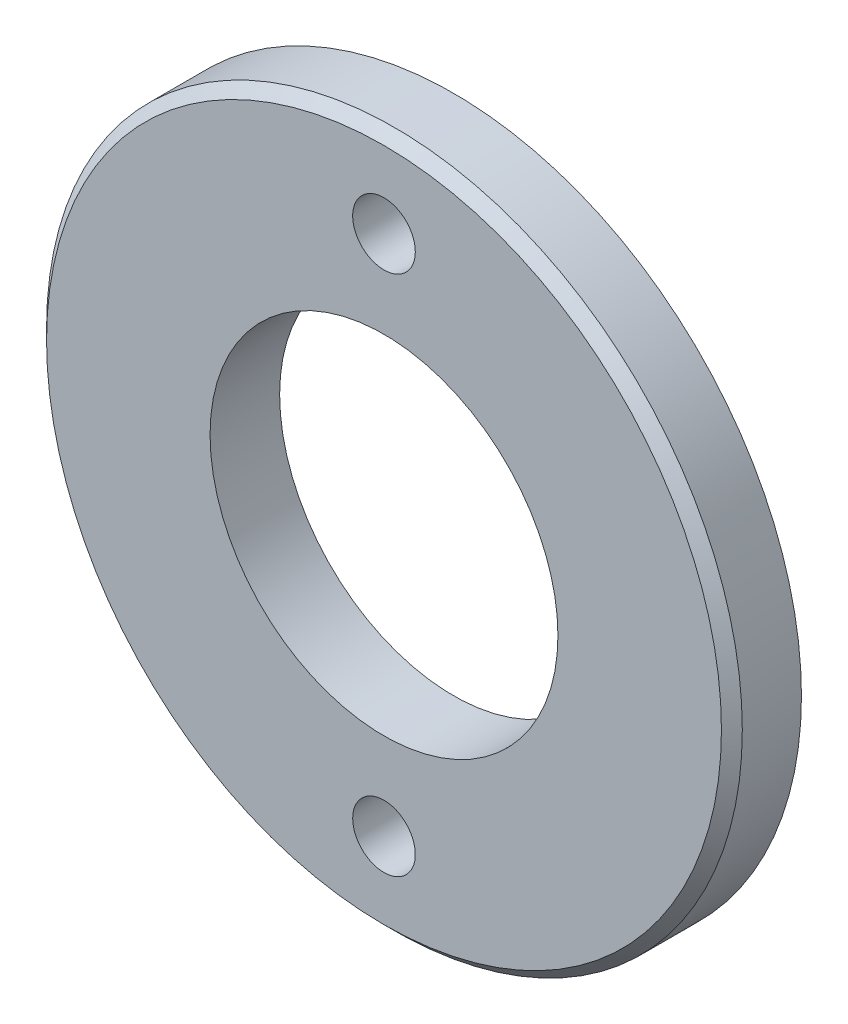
ISO-10303-21;
HEADER;
FILE_DESCRIPTION(('STEP AP214'),'2;1');
FILE_NAME('part.step','',(''),(''),'','','');
FILE_SCHEMA(('AUTOMOTIVE_DESIGN { 1 0 10303 214 1 1 1 1 }'));
ENDSEC;
DATA;
#1=APPLICATION_CONTEXT('core data for automotive mechanical design processes');
#2=APPLICATION_PROTOCOL_DEFINITION('international standard','automotive_design',2000,#1);
#3=PRODUCT_CONTEXT('',#1,'mechanical');
#4=PRODUCT('Part','Part','',(#3));
#5=PRODUCT_RELATED_PRODUCT_CATEGORY('part','',(#4));
#6=PRODUCT_DEFINITION_FORMATION('','',#4);
#7=PRODUCT_DEFINITION_CONTEXT('part definition',#1,'design');
#8=PRODUCT_DEFINITION('design','',#6,#7);
#9=PRODUCT_DEFINITION_SHAPE('','',#8);
#10=(LENGTH_UNIT() NAMED_UNIT(*) SI_UNIT(.MILLI.,.METRE.));
#11=(NAMED_UNIT(*) PLANE_ANGLE_UNIT() SI_UNIT($,.RADIAN.));
#12=(NAMED_UNIT(*) SI_UNIT($,.STERADIAN.) SOLID_ANGLE_UNIT());
#13=UNCERTAINTY_MEASURE_WITH_UNIT(LENGTH_MEASURE(1.E-05),#10,'distance_accuracy_value','');
#14=(GEOMETRIC_REPRESENTATION_CONTEXT(3) GLOBAL_UNCERTAINTY_ASSIGNED_CONTEXT((#13)) GLOBAL_UNIT_ASSIGNED_CONTEXT((#10,
#11,#12)) REPRESENTATION_CONTEXT('',''));
#15=CARTESIAN_POINT('',(0.,0.,0.));
#16=DIRECTION('',(0.,0.,1.));
#17=DIRECTION('',(1.,0.,0.));
#18=AXIS2_PLACEMENT_3D('',#15,#16,#17);
#19=CARTESIAN_POINT('',(0.,0.,2.54));
#20=DIRECTION('',(0.,0.,-1.));
#21=DIRECTION('',(-1.,0.,0.));
#22=AXIS2_PLACEMENT_3D('',#19,#20,#21);
#23=CYLINDRICAL_SURFACE('',#22,25.4);
#24=CARTESIAN_POINT('',(0.,0.,1.778));
#25=DIRECTION('',(0.,0.,1.));
#26=DIRECTION('',(1.,0.,0.));
#27=AXIS2_PLACEMENT_3D('',#24,#25,#26);
#28=CIRCLE('',#27,25.4);
#29=CARTESIAN_POINT('',(25.4,0.,1.778));
#30=VERTEX_POINT('',#29);
#31=EDGE_CURVE('E10',#30,#30,#28,.F.);
#32=ORIENTED_EDGE('',*,*,#31,.T.);
#33=EDGE_LOOP('',(#32));
#34=FACE_BOUND('',#33,.T.);
#35=CARTESIAN_POINT('',(0.,0.,-2.54));
#36=DIRECTION('',(0.,0.,1.));
#37=DIRECTION('',(1.,0.,0.));
#38=AXIS2_PLACEMENT_3D('',#35,#36,#37);
#39=CIRCLE('',#38,25.4);
#40=CARTESIAN_POINT('',(25.4,0.,-2.54));
#41=VERTEX_POINT('',#40);
#42=EDGE_CURVE('E42',#41,#41,#39,.T.);
#43=ORIENTED_EDGE('',*,*,#42,.T.);
#44=EDGE_LOOP('',(#43));
#45=FACE_BOUND('',#44,.T.);
#46=ADVANCED_FACE('F31',(#34,#45),#23,.T.);
#47=CARTESIAN_POINT('',(0.,0.,2.54));
#48=DIRECTION('',(0.,0.,1.));
#49=DIRECTION('',(1.,0.,0.));
#50=AXIS2_PLACEMENT_3D('',#47,#48,#49);
#51=PLANE('',#50);
#52=CARTESIAN_POINT('',(0.,0.,2.54));
#53=DIRECTION('',(0.,0.,1.));
#54=DIRECTION('',(1.,0.,0.));
#55=AXIS2_PLACEMENT_3D('',#52,#53,#54);
#56=CIRCLE('',#55,24.638);
#57=CARTESIAN_POINT('',(24.638,0.,2.54));
#58=VERTEX_POINT('',#57);
#59=EDGE_CURVE('E38',#58,#58,#56,.T.);
#60=ORIENTED_EDGE('',*,*,#59,.T.);
#61=EDGE_LOOP('',(#60));
#62=FACE_BOUND('',#61,.T.);
#63=CARTESIAN_POINT('',(-1.33025439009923E-13,-19.05,2.54));
#64=DIRECTION('',(0.,0.,1.));
#65=DIRECTION('',(-1.,0.,0.));
#66=AXIS2_PLACEMENT_3D('',#63,#64,#65);
#67=CIRCLE('',#66,2.286);
#68=CARTESIAN_POINT('',(-2.28600000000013,-19.05,2.54));
#69=VERTEX_POINT('',#68);
#70=EDGE_CURVE('E61',#69,#69,#67,.T.);
#71=ORIENTED_EDGE('',*,*,#70,.F.);
#72=EDGE_LOOP('',(#71));
#73=FACE_BOUND('',#72,.T.);
#74=CARTESIAN_POINT('',(0.,19.05,2.54));
#75=DIRECTION('',(0.,0.,1.));
#76=DIRECTION('',(1.,0.,0.));
#77=AXIS2_PLACEMENT_3D('',#74,#75,#76);
#78=CIRCLE('',#77,2.286);
#79=CARTESIAN_POINT('',(2.286,19.05,2.54));
#80=VERTEX_POINT('',#79);
#81=EDGE_CURVE('E55',#80,#80,#78,.T.);
#82=ORIENTED_EDGE('',*,*,#81,.F.);
#83=EDGE_LOOP('',(#82));
#84=FACE_BOUND('',#83,.T.);
#85=CARTESIAN_POINT('',(0.,0.,2.54));
#86=DIRECTION('',(0.,0.,1.));
#87=DIRECTION('',(1.,0.,0.));
#88=AXIS2_PLACEMENT_3D('',#85,#86,#87);
#89=CIRCLE('',#88,12.7);
#90=CARTESIAN_POINT('',(12.7,0.,2.54));
#91=VERTEX_POINT('',#90);
#92=EDGE_CURVE('E49',#91,#91,#89,.T.);
#93=ORIENTED_EDGE('',*,*,#92,.F.);
#94=EDGE_LOOP('',(#93));
#95=FACE_BOUND('',#94,.T.);
#96=ADVANCED_FACE('F77',(#62,#73,#84,#95),#51,.T.);
#97=CARTESIAN_POINT('',(0.,0.,-2.54));
#98=DIRECTION('',(0.,0.,1.));
#99=DIRECTION('',(1.,0.,0.));
#100=AXIS2_PLACEMENT_3D('',#97,#98,#99);
#101=PLANE('',#100);
#102=CARTESIAN_POINT('',(-1.33025439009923E-13,-19.05,-2.54));
#103=DIRECTION('',(0.,0.,1.));
#104=DIRECTION('',(-1.,0.,0.));
#105=AXIS2_PLACEMENT_3D('',#102,#103,#104);
#106=CIRCLE('',#105,2.286);
#107=CARTESIAN_POINT('',(-2.28600000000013,-19.05,-2.54));
#108=VERTEX_POINT('',#107);
#109=EDGE_CURVE('E58',#108,#108,#106,.T.);
#110=ORIENTED_EDGE('',*,*,#109,.T.);
#111=EDGE_LOOP('',(#110));
#112=FACE_BOUND('',#111,.T.);
#113=CARTESIAN_POINT('',(0.,19.05,-2.54));
#114=DIRECTION('',(0.,0.,1.));
#115=DIRECTION('',(1.,0.,0.));
#116=AXIS2_PLACEMENT_3D('',#113,#114,#115);
#117=CIRCLE('',#116,2.286);
#118=CARTESIAN_POINT('',(2.286,19.05,-2.54));
#119=VERTEX_POINT('',#118);
#120=EDGE_CURVE('E52',#119,#119,#117,.T.);
#121=ORIENTED_EDGE('',*,*,#120,.T.);
#122=EDGE_LOOP('',(#121));
#123=FACE_BOUND('',#122,.T.);
#124=CARTESIAN_POINT('',(0.,0.,-2.54));
#125=DIRECTION('',(0.,0.,1.));
#126=DIRECTION('',(1.,0.,0.));
#127=AXIS2_PLACEMENT_3D('',#124,#125,#126);
#128=CIRCLE('',#127,12.7);
#129=CARTESIAN_POINT('',(12.7,0.,-2.54));
#130=VERTEX_POINT('',#129);
#131=EDGE_CURVE('E46',#130,#130,#128,.T.);
#132=ORIENTED_EDGE('',*,*,#131,.T.);
#133=EDGE_LOOP('',(#132));
#134=FACE_BOUND('',#133,.T.);
#135=ORIENTED_EDGE('',*,*,#42,.F.);
#136=EDGE_LOOP('',(#135));
#137=FACE_BOUND('',#136,.T.);
#138=ADVANCED_FACE('F67',(#112,#123,#134,#137),#101,.F.);
#139=CARTESIAN_POINT('',(0.,0.,-2.54));
#140=DIRECTION('',(0.,0.,1.));
#141=DIRECTION('',(1.,0.,0.));
#142=AXIS2_PLACEMENT_3D('',#139,#140,#141);
#143=CYLINDRICAL_SURFACE('',#142,12.7);
#144=ORIENTED_EDGE('',*,*,#131,.F.);
#145=EDGE_LOOP('',(#144));
#146=FACE_BOUND('',#145,.T.);
#147=ORIENTED_EDGE('',*,*,#92,.T.);
#148=EDGE_LOOP('',(#147));
#149=FACE_BOUND('',#148,.T.);
#150=ADVANCED_FACE('F85',(#146,#149),#143,.F.);
#151=CARTESIAN_POINT('',(0.,19.05,-2.54));
#152=DIRECTION('',(0.,0.,1.));
#153=DIRECTION('',(1.,0.,0.));
#154=AXIS2_PLACEMENT_3D('',#151,#152,#153);
#155=CYLINDRICAL_SURFACE('',#154,2.286);
#156=ORIENTED_EDGE('',*,*,#120,.F.);
#157=EDGE_LOOP('',(#156));
#158=FACE_BOUND('',#157,.T.);
#159=ORIENTED_EDGE('',*,*,#81,.T.);
#160=EDGE_LOOP('',(#159));
#161=FACE_BOUND('',#160,.T.);
#162=ADVANCED_FACE('F73',(#158,#161),#155,.F.);
#163=CARTESIAN_POINT('',(-1.33025439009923E-13,-19.05,-2.54));
#164=DIRECTION('',(0.,0.,1.));
#165=DIRECTION('',(1.,0.,0.));
#166=AXIS2_PLACEMENT_3D('',#163,#164,#165);
#167=CYLINDRICAL_SURFACE('',#166,2.286);
#168=ORIENTED_EDGE('',*,*,#109,.F.);
#169=EDGE_LOOP('',(#168));
#170=FACE_BOUND('',#169,.T.);
#171=ORIENTED_EDGE('',*,*,#70,.T.);
#172=EDGE_LOOP('',(#171));
#173=FACE_BOUND('',#172,.T.);
#174=ADVANCED_FACE('F70',(#170,#173),#167,.F.);
#175=CARTESIAN_POINT('',(0.,0.,2.54));
#176=DIRECTION('',(0.,0.,-1.));
#177=DIRECTION('',(-1.,0.,0.));
#178=AXIS2_PLACEMENT_3D('',#175,#176,#177);
#179=CONICAL_SURFACE('',#178,24.638,0.785398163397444);
#180=ORIENTED_EDGE('',*,*,#31,.F.);
#181=EDGE_LOOP('',(#180));
#182=FACE_BOUND('',#181,.T.);
#183=ORIENTED_EDGE('',*,*,#59,.F.);
#184=EDGE_LOOP('',(#183));
#185=FACE_BOUND('',#184,.T.);
#186=ADVANCED_FACE('F33',(#182,#185),#179,.T.);
#187=CLOSED_SHELL('',(#46,#96,#138,#150,#162,#174,#186));
#188=MANIFOLD_SOLID_BREP('B2',#187);
#189=ADVANCED_BREP_SHAPE_REPRESENTATION('',(#18,#188),#14);
#190=SHAPE_DEFINITION_REPRESENTATION(#9,#189);
ENDSEC;
END-ISO-10303-21;
